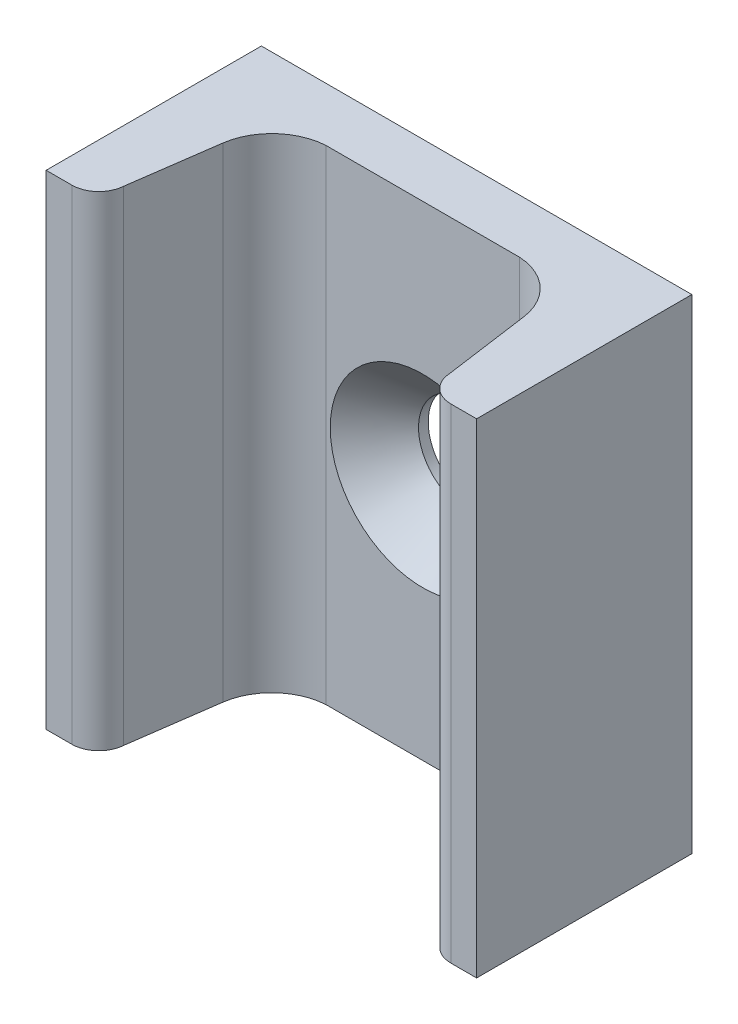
ISO-10303-21;
HEADER;
FILE_DESCRIPTION(('STEP AP214'),'2;1');
FILE_NAME('part.step','',(''),(''),'','','');
FILE_SCHEMA(('AUTOMOTIVE_DESIGN { 1 0 10303 214 1 1 1 1 }'));
ENDSEC;
DATA;
#1=APPLICATION_CONTEXT('core data for automotive mechanical design processes');
#2=APPLICATION_PROTOCOL_DEFINITION('international standard','automotive_design',2000,#1);
#3=PRODUCT_CONTEXT('',#1,'mechanical');
#4=PRODUCT('Part','Part','',(#3));
#5=PRODUCT_RELATED_PRODUCT_CATEGORY('part','',(#4));
#6=PRODUCT_DEFINITION_FORMATION('','',#4);
#7=PRODUCT_DEFINITION_CONTEXT('part definition',#1,'design');
#8=PRODUCT_DEFINITION('design','',#6,#7);
#9=PRODUCT_DEFINITION_SHAPE('','',#8);
#10=(LENGTH_UNIT() NAMED_UNIT(*) SI_UNIT(.MILLI.,.METRE.));
#11=(NAMED_UNIT(*) PLANE_ANGLE_UNIT() SI_UNIT($,.RADIAN.));
#12=(NAMED_UNIT(*) SI_UNIT($,.STERADIAN.) SOLID_ANGLE_UNIT());
#13=UNCERTAINTY_MEASURE_WITH_UNIT(LENGTH_MEASURE(1.E-05),#10,'distance_accuracy_value','');
#14=(GEOMETRIC_REPRESENTATION_CONTEXT(3) GLOBAL_UNCERTAINTY_ASSIGNED_CONTEXT((#13)) GLOBAL_UNIT_ASSIGNED_CONTEXT((#10,
#11,#12)) REPRESENTATION_CONTEXT('',''));
#15=CARTESIAN_POINT('',(0.,0.,0.));
#16=DIRECTION('',(0.,0.,1.));
#17=DIRECTION('',(1.,0.,0.));
#18=AXIS2_PLACEMENT_3D('',#15,#16,#17);
#19=CARTESIAN_POINT('',(8.68423556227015,-22.5,10.342034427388));
#20=DIRECTION('',(0.,1.,0.));
#21=DIRECTION('',(0.,0.,1.));
#22=AXIS2_PLACEMENT_3D('',#19,#20,#21);
#23=CYLINDRICAL_SURFACE('',#22,5.35135861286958);
#24=DIRECTION('',(0.,1.,0.));
#25=VECTOR('',#24,1.);
#26=CARTESIAN_POINT('',(8.99999999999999,-22.5,4.99999999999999));
#27=LINE('',#26,#25);
#28=CARTESIAN_POINT('',(9.00000000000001,-22.5,4.99999999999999));
#29=VERTEX_POINT('',#28);
#30=CARTESIAN_POINT('',(9.00000000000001,22.5,4.99999999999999));
#31=VERTEX_POINT('',#30);
#32=EDGE_CURVE('E168',#29,#31,#27,.T.);
#33=ORIENTED_EDGE('',*,*,#32,.F.);
#34=CARTESIAN_POINT('',(8.68423556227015,-22.5,10.342034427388));
#35=DIRECTION('',(0.,1.,0.));
#36=DIRECTION('',(0.,0.,1.));
#37=AXIS2_PLACEMENT_3D('',#34,#35,#36);
#38=CIRCLE('',#37,5.35135861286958);
#39=CARTESIAN_POINT('',(13.9840763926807,-22.5,9.60127388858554));
#40=VERTEX_POINT('',#39);
#41=EDGE_CURVE('E149',#40,#29,#38,.T.);
#42=ORIENTED_EDGE('',*,*,#41,.F.);
#43=DIRECTION('',(0.,1.,0.));
#44=VECTOR('',#43,1.);
#45=CARTESIAN_POINT('',(13.9840763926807,-22.5,9.60127388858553));
#46=LINE('',#45,#44);
#47=CARTESIAN_POINT('',(13.9840763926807,22.5,9.60127388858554));
#48=VERTEX_POINT('',#47);
#49=EDGE_CURVE('E136',#48,#40,#46,.F.);
#50=ORIENTED_EDGE('',*,*,#49,.F.);
#51=CARTESIAN_POINT('',(8.68423556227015,22.5,10.342034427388));
#52=DIRECTION('',(0.,1.,0.));
#53=DIRECTION('',(0.,0.,1.));
#54=AXIS2_PLACEMENT_3D('',#51,#52,#53);
#55=CIRCLE('',#54,5.35135861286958);
#56=EDGE_CURVE('E190',#48,#31,#55,.T.);
#57=ORIENTED_EDGE('',*,*,#56,.T.);
#58=EDGE_LOOP('',(#33,#42,#50,#57));
#59=FACE_BOUND('',#58,.T.);
#60=ADVANCED_FACE('F15',(#59),#23,.F.);
#61=CARTESIAN_POINT('',(8.99999999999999,-22.5,4.99999999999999));
#62=DIRECTION('',(0.,0.,1.));
#63=DIRECTION('',(1.,0.,0.));
#64=AXIS2_PLACEMENT_3D('',#61,#62,#63);
#65=PLANE('',#64);
#66=CARTESIAN_POINT('',(0.,0.,5.00000000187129));
#67=DIRECTION('',(0.,0.,1.));
#68=DIRECTION('',(1.,0.,0.));
#69=AXIS2_PLACEMENT_3D('',#66,#67,#68);
#70=CIRCLE('',#69,8.59999999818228);
#71=CARTESIAN_POINT('',(8.59999999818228,0.,5.00000000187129));
#72=VERTEX_POINT('',#71);
#73=EDGE_CURVE('E18',#72,#72,#70,.F.);
#74=ORIENTED_EDGE('',*,*,#73,.T.);
#75=EDGE_LOOP('',(#74));
#76=FACE_BOUND('',#75,.T.);
#77=DIRECTION('',(1.,0.,0.));
#78=VECTOR('',#77,1.);
#79=CARTESIAN_POINT('',(0.,-22.5,4.99999999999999));
#80=LINE('',#79,#78);
#81=CARTESIAN_POINT('',(-9.00000000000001,-22.5,4.99999999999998));
#82=VERTEX_POINT('',#81);
#83=EDGE_CURVE('E187',#29,#82,#80,.F.);
#84=ORIENTED_EDGE('',*,*,#83,.F.);
#85=ORIENTED_EDGE('',*,*,#32,.T.);
#86=DIRECTION('',(1.,0.,0.));
#87=VECTOR('',#86,1.);
#88=CARTESIAN_POINT('',(0.,22.5,4.99999999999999));
#89=LINE('',#88,#87);
#90=CARTESIAN_POINT('',(-9.00000000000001,22.5,4.99999999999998));
#91=VERTEX_POINT('',#90);
#92=EDGE_CURVE('E173',#31,#91,#89,.F.);
#93=ORIENTED_EDGE('',*,*,#92,.T.);
#94=DIRECTION('',(0.,1.,0.));
#95=VECTOR('',#94,1.);
#96=CARTESIAN_POINT('',(-8.99999999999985,-22.5,4.99999999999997));
#97=LINE('',#96,#95);
#98=EDGE_CURVE('E101',#91,#82,#97,.F.);
#99=ORIENTED_EDGE('',*,*,#98,.T.);
#100=EDGE_LOOP('',(#84,#85,#93,#99));
#101=FACE_BOUND('',#100,.T.);
#102=ADVANCED_FACE('F258',(#76,#101),#65,.T.);
#103=CARTESIAN_POINT('',(-8.68423556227,-22.5,10.342034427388));
#104=DIRECTION('',(0.,1.,0.));
#105=DIRECTION('',(0.,0.,1.));
#106=AXIS2_PLACEMENT_3D('',#103,#104,#105);
#107=CYLINDRICAL_SURFACE('',#106,5.35135861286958);
#108=DIRECTION('',(0.,1.,0.));
#109=VECTOR('',#108,1.);
#110=CARTESIAN_POINT('',(-13.9840763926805,-22.5,9.60127388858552));
#111=LINE('',#110,#109);
#112=CARTESIAN_POINT('',(-13.9840763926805,-22.5,9.60127388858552));
#113=VERTEX_POINT('',#112);
#114=CARTESIAN_POINT('',(-13.9840763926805,22.5,9.60127388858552));
#115=VERTEX_POINT('',#114);
#116=EDGE_CURVE('E107',#113,#115,#111,.T.);
#117=ORIENTED_EDGE('',*,*,#116,.F.);
#118=CARTESIAN_POINT('',(-8.68423556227,-22.5,10.342034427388));
#119=DIRECTION('',(0.,1.,0.));
#120=DIRECTION('',(0.,0.,1.));
#121=AXIS2_PLACEMENT_3D('',#118,#119,#120);
#122=CIRCLE('',#121,5.35135861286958);
#123=EDGE_CURVE('E185',#82,#113,#122,.T.);
#124=ORIENTED_EDGE('',*,*,#123,.F.);
#125=ORIENTED_EDGE('',*,*,#98,.F.);
#126=CARTESIAN_POINT('',(-8.68423556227,22.5,10.342034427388));
#127=DIRECTION('',(0.,1.,0.));
#128=DIRECTION('',(0.,0.,1.));
#129=AXIS2_PLACEMENT_3D('',#126,#127,#128);
#130=CIRCLE('',#129,5.35135861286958);
#131=EDGE_CURVE('E104',#91,#115,#130,.T.);
#132=ORIENTED_EDGE('',*,*,#131,.T.);
#133=EDGE_LOOP('',(#117,#124,#125,#132));
#134=FACE_BOUND('',#133,.T.);
#135=ADVANCED_FACE('F106',(#134),#107,.F.);
#136=CARTESIAN_POINT('',(-13.9840763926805,-22.5,9.60127388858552));
#137=DIRECTION('',(0.990372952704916,0.,0.138424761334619));
#138=DIRECTION('',(0.138424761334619,0.,-0.990372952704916));
#139=AXIS2_PLACEMENT_3D('',#136,#137,#138);
#140=PLANE('',#139);
#141=DIRECTION('',(-0.138424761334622,0.,0.990372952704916));
#142=VECTOR('',#141,1.);
#143=CARTESIAN_POINT('',(-13.9840763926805,-22.5,9.60127388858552));
#144=LINE('',#143,#142);
#145=CARTESIAN_POINT('',(-15.1159490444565,-22.5,17.6993630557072));
#146=VERTEX_POINT('',#145);
#147=EDGE_CURVE('E117',#113,#146,#144,.T.);
#148=ORIENTED_EDGE('',*,*,#147,.F.);
#149=ORIENTED_EDGE('',*,*,#116,.T.);
#150=DIRECTION('',(-0.138424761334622,0.,0.990372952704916));
#151=VECTOR('',#150,1.);
#152=CARTESIAN_POINT('',(-13.9840763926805,22.5,9.60127388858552));
#153=LINE('',#152,#151);
#154=CARTESIAN_POINT('',(-15.1159490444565,22.5,17.6993630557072));
#155=VERTEX_POINT('',#154);
#156=EDGE_CURVE('E112',#115,#155,#153,.T.);
#157=ORIENTED_EDGE('',*,*,#156,.T.);
#158=DIRECTION('',(0.,1.,0.));
#159=VECTOR('',#158,1.);
#160=CARTESIAN_POINT('',(-15.1159490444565,-22.5,17.6993630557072));
#161=LINE('',#160,#159);
#162=EDGE_CURVE('E119',#146,#155,#161,.T.);
#163=ORIENTED_EDGE('',*,*,#162,.F.);
#164=EDGE_LOOP('',(#148,#149,#157,#163));
#165=FACE_BOUND('',#164,.T.);
#166=ADVANCED_FACE('F114',(#165),#140,.T.);
#167=CARTESIAN_POINT('',(-17.6079872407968,-22.5,17.4999999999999));
#168=DIRECTION('',(0.,1.,0.));
#169=DIRECTION('',(0.,0.,1.));
#170=AXIS2_PLACEMENT_3D('',#167,#168,#169);
#171=CYLINDRICAL_SURFACE('',#170,2.49999999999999);
#172=CARTESIAN_POINT('',(-17.6079872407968,-22.5,17.4999999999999));
#173=DIRECTION('',(0.,1.,0.));
#174=DIRECTION('',(0.,0.,1.));
#175=AXIS2_PLACEMENT_3D('',#172,#173,#174);
#176=CIRCLE('',#175,2.49999999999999);
#177=CARTESIAN_POINT('',(-17.6079872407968,-22.5,19.9999999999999));
#178=VERTEX_POINT('',#177);
#179=EDGE_CURVE('E182',#146,#178,#176,.F.);
#180=ORIENTED_EDGE('',*,*,#179,.F.);
#181=ORIENTED_EDGE('',*,*,#162,.T.);
#182=CARTESIAN_POINT('',(-17.6079872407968,22.5,17.4999999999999));
#183=DIRECTION('',(0.,1.,0.));
#184=DIRECTION('',(0.,0.,1.));
#185=AXIS2_PLACEMENT_3D('',#182,#183,#184);
#186=CIRCLE('',#185,2.49999999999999);
#187=CARTESIAN_POINT('',(-17.6079872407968,22.5,19.9999999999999));
#188=VERTEX_POINT('',#187);
#189=EDGE_CURVE('E125',#155,#188,#186,.F.);
#190=ORIENTED_EDGE('',*,*,#189,.T.);
#191=DIRECTION('',(0.,1.,0.));
#192=VECTOR('',#191,1.);
#193=CARTESIAN_POINT('',(-17.6079872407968,-22.5,19.9999999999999));
#194=LINE('',#193,#192);
#195=EDGE_CURVE('E135',#178,#188,#194,.T.);
#196=ORIENTED_EDGE('',*,*,#195,.F.);
#197=EDGE_LOOP('',(#180,#181,#190,#196));
#198=FACE_BOUND('',#197,.T.);
#199=ADVANCED_FACE('F270',(#198),#171,.T.);
#200=CARTESIAN_POINT('',(20.0000000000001,-22.5,19.9999999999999));
#201=DIRECTION('',(0.,0.,1.));
#202=DIRECTION('',(1.,0.,0.));
#203=AXIS2_PLACEMENT_3D('',#200,#201,#202);
#204=PLANE('',#203);
#205=DIRECTION('',(1.,0.,0.));
#206=VECTOR('',#205,1.);
#207=CARTESIAN_POINT('',(0.,-22.5,19.9999999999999));
#208=LINE('',#207,#206);
#209=CARTESIAN_POINT('',(20.0000000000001,-22.5,19.9999999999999));
#210=VERTEX_POINT('',#209);
#211=CARTESIAN_POINT('',(17.6079872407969,-22.5,19.9999999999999));
#212=VERTEX_POINT('',#211);
#213=EDGE_CURVE('E145',#210,#212,#208,.F.);
#214=ORIENTED_EDGE('',*,*,#213,.F.);
#215=DIRECTION('',(0.,1.,0.));
#216=VECTOR('',#215,1.);
#217=CARTESIAN_POINT('',(20.0000000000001,-22.5,19.9999999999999));
#218=LINE('',#217,#216);
#219=CARTESIAN_POINT('',(20.0000000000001,22.5,19.9999999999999));
#220=VERTEX_POINT('',#219);
#221=EDGE_CURVE('E147',#220,#210,#218,.F.);
#222=ORIENTED_EDGE('',*,*,#221,.F.);
#223=DIRECTION('',(1.,0.,0.));
#224=VECTOR('',#223,1.);
#225=CARTESIAN_POINT('',(0.,22.5,19.9999999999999));
#226=LINE('',#225,#224);
#227=CARTESIAN_POINT('',(17.6079872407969,22.5,19.9999999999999));
#228=VERTEX_POINT('',#227);
#229=EDGE_CURVE('E194',#220,#228,#226,.F.);
#230=ORIENTED_EDGE('',*,*,#229,.T.);
#231=DIRECTION('',(0.,1.,0.));
#232=VECTOR('',#231,1.);
#233=CARTESIAN_POINT('',(17.6079872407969,-22.5,19.9999999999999));
#234=LINE('',#233,#232);
#235=EDGE_CURVE('E139',#212,#228,#234,.T.);
#236=ORIENTED_EDGE('',*,*,#235,.F.);
#237=EDGE_LOOP('',(#214,#222,#230,#236));
#238=FACE_BOUND('',#237,.T.);
#239=ADVANCED_FACE('F268',(#238),#204,.T.);
#240=CARTESIAN_POINT('',(17.6079872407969,-22.5,17.4999999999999));
#241=DIRECTION('',(0.,1.,0.));
#242=DIRECTION('',(0.,0.,1.));
#243=AXIS2_PLACEMENT_3D('',#240,#241,#242);
#244=CYLINDRICAL_SURFACE('',#243,2.49999999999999);
#245=CARTESIAN_POINT('',(17.6079872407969,-22.5,17.4999999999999));
#246=DIRECTION('',(0.,1.,0.));
#247=DIRECTION('',(0.,0.,1.));
#248=AXIS2_PLACEMENT_3D('',#245,#246,#247);
#249=CIRCLE('',#248,2.49999999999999);
#250=CARTESIAN_POINT('',(15.1159490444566,-22.5,17.6993630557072));
#251=VERTEX_POINT('',#250);
#252=EDGE_CURVE('E179',#212,#251,#249,.F.);
#253=ORIENTED_EDGE('',*,*,#252,.F.);
#254=ORIENTED_EDGE('',*,*,#235,.T.);
#255=CARTESIAN_POINT('',(17.6079872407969,22.5,17.4999999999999));
#256=DIRECTION('',(0.,1.,0.));
#257=DIRECTION('',(0.,0.,1.));
#258=AXIS2_PLACEMENT_3D('',#255,#256,#257);
#259=CIRCLE('',#258,2.49999999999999);
#260=CARTESIAN_POINT('',(15.1159490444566,22.5,17.6993630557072));
#261=VERTEX_POINT('',#260);
#262=EDGE_CURVE('E193',#228,#261,#259,.F.);
#263=ORIENTED_EDGE('',*,*,#262,.T.);
#264=DIRECTION('',(0.,1.,0.));
#265=VECTOR('',#264,1.);
#266=CARTESIAN_POINT('',(15.1159490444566,-22.5,17.6993630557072));
#267=LINE('',#266,#265);
#268=EDGE_CURVE('E132',#251,#261,#267,.T.);
#269=ORIENTED_EDGE('',*,*,#268,.F.);
#270=EDGE_LOOP('',(#253,#254,#263,#269));
#271=FACE_BOUND('',#270,.T.);
#272=ADVANCED_FACE('F267',(#271),#244,.T.);
#273=CARTESIAN_POINT('',(15.1159490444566,-22.5,17.6993630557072));
#274=DIRECTION('',(-0.990372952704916,0.,0.138424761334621));
#275=DIRECTION('',(0.138424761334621,0.,0.990372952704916));
#276=AXIS2_PLACEMENT_3D('',#273,#274,#275);
#277=PLANE('',#276);
#278=DIRECTION('',(-0.138424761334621,0.,-0.990372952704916));
#279=VECTOR('',#278,1.);
#280=CARTESIAN_POINT('',(15.1159490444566,-22.5,17.6993630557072));
#281=LINE('',#280,#279);
#282=EDGE_CURVE('E177',#251,#40,#281,.T.);
#283=ORIENTED_EDGE('',*,*,#282,.F.);
#284=ORIENTED_EDGE('',*,*,#268,.T.);
#285=DIRECTION('',(-0.138424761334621,0.,-0.990372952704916));
#286=VECTOR('',#285,1.);
#287=CARTESIAN_POINT('',(15.1159490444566,22.5,17.6993630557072));
#288=LINE('',#287,#286);
#289=EDGE_CURVE('E192',#261,#48,#288,.T.);
#290=ORIENTED_EDGE('',*,*,#289,.T.);
#291=ORIENTED_EDGE('',*,*,#49,.T.);
#292=EDGE_LOOP('',(#283,#284,#290,#291));
#293=FACE_BOUND('',#292,.T.);
#294=ADVANCED_FACE('F265',(#293),#277,.T.);
#295=CARTESIAN_POINT('',(-17.6079872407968,-22.5,19.9999999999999));
#296=DIRECTION('',(0.,0.,1.));
#297=DIRECTION('',(1.,0.,0.));
#298=AXIS2_PLACEMENT_3D('',#295,#296,#297);
#299=PLANE('',#298);
#300=DIRECTION('',(1.,0.,0.));
#301=VECTOR('',#300,1.);
#302=CARTESIAN_POINT('',(0.,-22.5,19.9999999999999));
#303=LINE('',#302,#301);
#304=CARTESIAN_POINT('',(-19.9999999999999,-22.5,19.9999999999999));
#305=VERTEX_POINT('',#304);
#306=EDGE_CURVE('E146',#178,#305,#303,.F.);
#307=ORIENTED_EDGE('',*,*,#306,.F.);
#308=ORIENTED_EDGE('',*,*,#195,.T.);
#309=DIRECTION('',(1.,0.,0.));
#310=VECTOR('',#309,1.);
#311=CARTESIAN_POINT('',(0.,22.5,19.9999999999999));
#312=LINE('',#311,#310);
#313=CARTESIAN_POINT('',(-19.9999999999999,22.5,19.9999999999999));
#314=VERTEX_POINT('',#313);
#315=EDGE_CURVE('E127',#188,#314,#312,.F.);
#316=ORIENTED_EDGE('',*,*,#315,.T.);
#317=DIRECTION('',(0.,1.,0.));
#318=VECTOR('',#317,1.);
#319=CARTESIAN_POINT('',(-19.9999999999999,-22.5,19.9999999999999));
#320=LINE('',#319,#318);
#321=EDGE_CURVE('E160',#305,#314,#320,.T.);
#322=ORIENTED_EDGE('',*,*,#321,.F.);
#323=EDGE_LOOP('',(#307,#308,#316,#322));
#324=FACE_BOUND('',#323,.T.);
#325=ADVANCED_FACE('F253',(#324),#299,.T.);
#326=CARTESIAN_POINT('',(0.,0.,5.00000000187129));
#327=DIRECTION('',(0.,0.,1.));
#328=DIRECTION('',(1.,0.,0.));
#329=AXIS2_PLACEMENT_3D('',#326,#327,#328);
#330=CONICAL_SURFACE('',#329,8.59999999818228,0.785398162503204);
#331=CARTESIAN_POINT('',(0.,0.,0.900000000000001));
#332=DIRECTION('',(0.,0.,1.));
#333=DIRECTION('',(1.,0.,0.));
#334=AXIS2_PLACEMENT_3D('',#331,#332,#333);
#335=CIRCLE('',#334,4.5);
#336=CARTESIAN_POINT('',(4.5,0.,0.900000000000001));
#337=VERTEX_POINT('',#336);
#338=EDGE_CURVE('E163',#337,#337,#335,.F.);
#339=ORIENTED_EDGE('',*,*,#338,.T.);
#340=EDGE_LOOP('',(#339));
#341=FACE_BOUND('',#340,.T.);
#342=ORIENTED_EDGE('',*,*,#73,.F.);
#343=EDGE_LOOP('',(#342));
#344=FACE_BOUND('',#343,.T.);
#345=ADVANCED_FACE('F250',(#341,#344),#330,.F.);
#346=CARTESIAN_POINT('',(0.,22.5,7.43933733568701));
#347=DIRECTION('',(0.,-1.,0.));
#348=DIRECTION('',(0.,0.,-1.));
#349=AXIS2_PLACEMENT_3D('',#346,#347,#348);
#350=PLANE('',#349);
#351=ORIENTED_EDGE('',*,*,#56,.F.);
#352=ORIENTED_EDGE('',*,*,#289,.F.);
#353=ORIENTED_EDGE('',*,*,#262,.F.);
#354=ORIENTED_EDGE('',*,*,#229,.F.);
#355=DIRECTION('',(0.,0.,-1.));
#356=VECTOR('',#355,1.);
#357=CARTESIAN_POINT('',(20.0000000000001,22.5,0.));
#358=LINE('',#357,#356);
#359=CARTESIAN_POINT('',(20.0000000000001,22.5,0.));
#360=VERTEX_POINT('',#359);
#361=EDGE_CURVE('E150',#360,#220,#358,.F.);
#362=ORIENTED_EDGE('',*,*,#361,.F.);
#363=DIRECTION('',(-1.,0.,0.));
#364=VECTOR('',#363,1.);
#365=CARTESIAN_POINT('',(-19.9999999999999,22.5,0.));
#366=LINE('',#365,#364);
#367=CARTESIAN_POINT('',(-19.9999999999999,22.5,0.));
#368=VERTEX_POINT('',#367);
#369=EDGE_CURVE('E157',#368,#360,#366,.F.);
#370=ORIENTED_EDGE('',*,*,#369,.F.);
#371=DIRECTION('',(0.,0.,1.));
#372=VECTOR('',#371,1.);
#373=CARTESIAN_POINT('',(-19.9999999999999,22.5,19.9999999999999));
#374=LINE('',#373,#372);
#375=EDGE_CURVE('E165',#314,#368,#374,.F.);
#376=ORIENTED_EDGE('',*,*,#375,.F.);
#377=ORIENTED_EDGE('',*,*,#315,.F.);
#378=ORIENTED_EDGE('',*,*,#189,.F.);
#379=ORIENTED_EDGE('',*,*,#156,.F.);
#380=ORIENTED_EDGE('',*,*,#131,.F.);
#381=ORIENTED_EDGE('',*,*,#92,.F.);
#382=EDGE_LOOP('',(#351,#352,#353,#354,#362,#370,#376,#377,#378,#379,#380,#381));
#383=FACE_BOUND('',#382,.T.);
#384=ADVANCED_FACE('F123',(#383),#350,.F.);
#385=CARTESIAN_POINT('',(20.0000000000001,-22.5,0.));
#386=DIRECTION('',(1.,0.,0.));
#387=DIRECTION('',(0.,0.,-1.));
#388=AXIS2_PLACEMENT_3D('',#385,#386,#387);
#389=PLANE('',#388);
#390=DIRECTION('',(0.,0.,-1.));
#391=VECTOR('',#390,1.);
#392=CARTESIAN_POINT('',(20.0000000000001,-22.5,7.43933733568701));
#393=LINE('',#392,#391);
#394=CARTESIAN_POINT('',(20.0000000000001,-22.5,0.));
#395=VERTEX_POINT('',#394);
#396=EDGE_CURVE('E142',#395,#210,#393,.F.);
#397=ORIENTED_EDGE('',*,*,#396,.F.);
#398=DIRECTION('',(0.,1.,0.));
#399=VECTOR('',#398,1.);
#400=CARTESIAN_POINT('',(20.0000000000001,-22.5,0.));
#401=LINE('',#400,#399);
#402=EDGE_CURVE('E154',#360,#395,#401,.F.);
#403=ORIENTED_EDGE('',*,*,#402,.F.);
#404=ORIENTED_EDGE('',*,*,#361,.T.);
#405=ORIENTED_EDGE('',*,*,#221,.T.);
#406=EDGE_LOOP('',(#397,#403,#404,#405));
#407=FACE_BOUND('',#406,.T.);
#408=ADVANCED_FACE('F224',(#407),#389,.T.);
#409=CARTESIAN_POINT('',(0.,-22.5,7.43933733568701));
#410=DIRECTION('',(0.,-1.,0.));
#411=DIRECTION('',(0.,0.,-1.));
#412=AXIS2_PLACEMENT_3D('',#409,#410,#411);
#413=PLANE('',#412);
#414=ORIENTED_EDGE('',*,*,#252,.T.);
#415=ORIENTED_EDGE('',*,*,#282,.T.);
#416=ORIENTED_EDGE('',*,*,#41,.T.);
#417=ORIENTED_EDGE('',*,*,#83,.T.);
#418=ORIENTED_EDGE('',*,*,#123,.T.);
#419=ORIENTED_EDGE('',*,*,#147,.T.);
#420=ORIENTED_EDGE('',*,*,#179,.T.);
#421=ORIENTED_EDGE('',*,*,#306,.T.);
#422=DIRECTION('',(0.,0.,1.));
#423=VECTOR('',#422,1.);
#424=CARTESIAN_POINT('',(-19.9999999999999,-22.5,19.9999999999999));
#425=LINE('',#424,#423);
#426=CARTESIAN_POINT('',(-19.9999999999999,-22.5,0.));
#427=VERTEX_POINT('',#426);
#428=EDGE_CURVE('E33',#427,#305,#425,.T.);
#429=ORIENTED_EDGE('',*,*,#428,.F.);
#430=DIRECTION('',(-1.,0.,0.));
#431=VECTOR('',#430,1.);
#432=CARTESIAN_POINT('',(-19.9999999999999,-22.5,0.));
#433=LINE('',#432,#431);
#434=EDGE_CURVE('E151',#395,#427,#433,.T.);
#435=ORIENTED_EDGE('',*,*,#434,.F.);
#436=ORIENTED_EDGE('',*,*,#396,.T.);
#437=ORIENTED_EDGE('',*,*,#213,.T.);
#438=EDGE_LOOP('',(#414,#415,#416,#417,#418,#419,#420,#421,#429,#435,#436,#437));
#439=FACE_BOUND('',#438,.T.);
#440=ADVANCED_FACE('F226',(#439),#413,.T.);
#441=CARTESIAN_POINT('',(-19.9999999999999,-22.5,19.9999999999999));
#442=DIRECTION('',(-1.,0.,0.));
#443=DIRECTION('',(0.,0.,1.));
#444=AXIS2_PLACEMENT_3D('',#441,#442,#443);
#445=PLANE('',#444);
#446=ORIENTED_EDGE('',*,*,#428,.T.);
#447=ORIENTED_EDGE('',*,*,#321,.T.);
#448=ORIENTED_EDGE('',*,*,#375,.T.);
#449=DIRECTION('',(0.,1.,0.));
#450=VECTOR('',#449,1.);
#451=CARTESIAN_POINT('',(-19.9999999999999,-22.5,0.));
#452=LINE('',#451,#450);
#453=EDGE_CURVE('E24',#427,#368,#452,.T.);
#454=ORIENTED_EDGE('',*,*,#453,.F.);
#455=EDGE_LOOP('',(#446,#447,#448,#454));
#456=FACE_BOUND('',#455,.T.);
#457=ADVANCED_FACE('F219',(#456),#445,.T.);
#458=CARTESIAN_POINT('',(0.,0.,0.450000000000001));
#459=DIRECTION('',(0.,0.,1.));
#460=DIRECTION('',(1.,0.,0.));
#461=AXIS2_PLACEMENT_3D('',#458,#459,#460);
#462=CYLINDRICAL_SURFACE('',#461,4.5);
#463=CARTESIAN_POINT('',(0.,0.,0.));
#464=DIRECTION('',(0.,0.,1.));
#465=DIRECTION('',(1.,0.,0.));
#466=AXIS2_PLACEMENT_3D('',#463,#464,#465);
#467=CIRCLE('',#466,4.5);
#468=CARTESIAN_POINT('',(4.5,0.,0.));
#469=VERTEX_POINT('',#468);
#470=EDGE_CURVE('E10',#469,#469,#467,.T.);
#471=ORIENTED_EDGE('',*,*,#470,.F.);
#472=EDGE_LOOP('',(#471));
#473=FACE_BOUND('',#472,.T.);
#474=ORIENTED_EDGE('',*,*,#338,.F.);
#475=EDGE_LOOP('',(#474));
#476=FACE_BOUND('',#475,.T.);
#477=ADVANCED_FACE('F235',(#473,#476),#462,.F.);
#478=CARTESIAN_POINT('',(-19.9999999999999,-22.5,0.));
#479=DIRECTION('',(0.,0.,-1.));
#480=DIRECTION('',(-1.,0.,0.));
#481=AXIS2_PLACEMENT_3D('',#478,#479,#480);
#482=PLANE('',#481);
#483=ORIENTED_EDGE('',*,*,#470,.T.);
#484=EDGE_LOOP('',(#483));
#485=FACE_BOUND('',#484,.T.);
#486=ORIENTED_EDGE('',*,*,#434,.T.);
#487=ORIENTED_EDGE('',*,*,#453,.T.);
#488=ORIENTED_EDGE('',*,*,#369,.T.);
#489=ORIENTED_EDGE('',*,*,#402,.T.);
#490=EDGE_LOOP('',(#486,#487,#488,#489));
#491=FACE_BOUND('',#490,.T.);
#492=ADVANCED_FACE('F217',(#485,#491),#482,.T.);
#493=CLOSED_SHELL('',(#60,#102,#135,#166,#199,#239,#272,#294,#325,#345,#384,#408,#440,#457,#477,#492));
#494=MANIFOLD_SOLID_BREP('B1',#493);
#495=ADVANCED_BREP_SHAPE_REPRESENTATION('',(#18,#494),#14);
#496=SHAPE_DEFINITION_REPRESENTATION(#9,#495);
ENDSEC;
END-ISO-10303-21;
